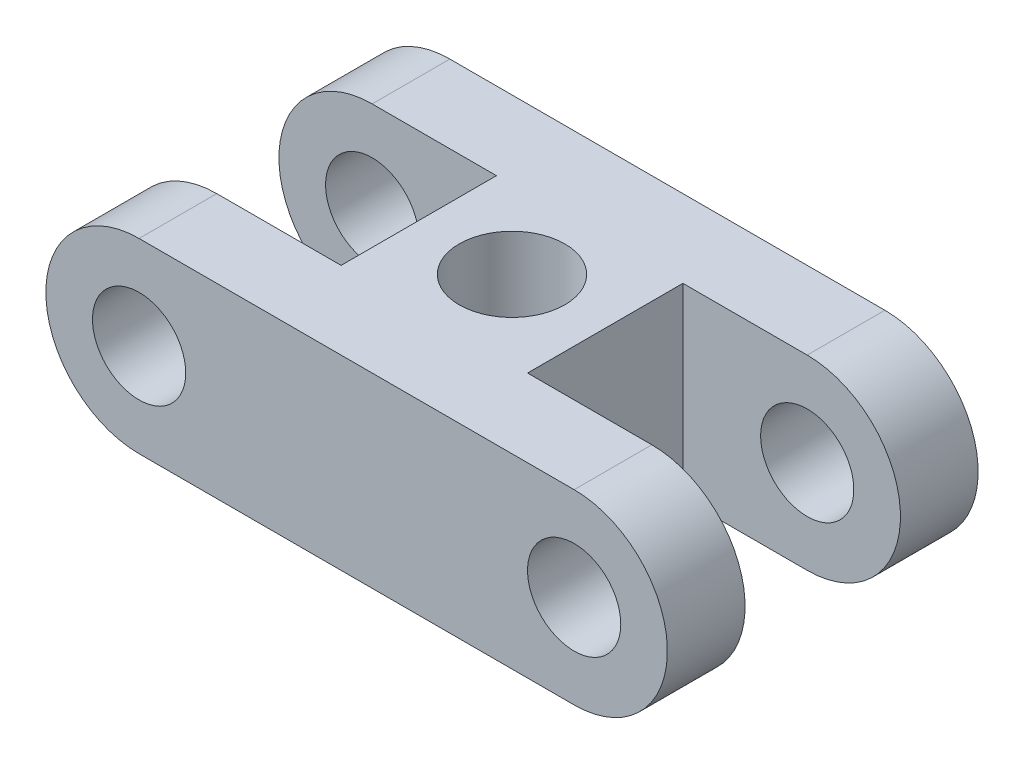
ISO-10303-21;
HEADER;
FILE_DESCRIPTION(('STEP AP214'),'2;1');
FILE_NAME('part.step','',(''),(''),'','','');
FILE_SCHEMA(('AUTOMOTIVE_DESIGN { 1 0 10303 214 1 1 1 1 }'));
ENDSEC;
DATA;
#1=APPLICATION_CONTEXT('core data for automotive mechanical design processes');
#2=APPLICATION_PROTOCOL_DEFINITION('international standard','automotive_design',2000,#1);
#3=PRODUCT_CONTEXT('',#1,'mechanical');
#4=PRODUCT('Part','Part','',(#3));
#5=PRODUCT_RELATED_PRODUCT_CATEGORY('part','',(#4));
#6=PRODUCT_DEFINITION_FORMATION('','',#4);
#7=PRODUCT_DEFINITION_CONTEXT('part definition',#1,'design');
#8=PRODUCT_DEFINITION('design','',#6,#7);
#9=PRODUCT_DEFINITION_SHAPE('','',#8);
#10=(LENGTH_UNIT() NAMED_UNIT(*) SI_UNIT(.MILLI.,.METRE.));
#11=(NAMED_UNIT(*) PLANE_ANGLE_UNIT() SI_UNIT($,.RADIAN.));
#12=(NAMED_UNIT(*) SI_UNIT($,.STERADIAN.) SOLID_ANGLE_UNIT());
#13=UNCERTAINTY_MEASURE_WITH_UNIT(LENGTH_MEASURE(1.E-05),#10,'distance_accuracy_value','');
#14=(GEOMETRIC_REPRESENTATION_CONTEXT(3) GLOBAL_UNCERTAINTY_ASSIGNED_CONTEXT((#13)) GLOBAL_UNIT_ASSIGNED_CONTEXT((#10,
#11,#12)) REPRESENTATION_CONTEXT('',''));
#15=CARTESIAN_POINT('',(0.,0.,0.));
#16=DIRECTION('',(0.,0.,1.));
#17=DIRECTION('',(1.,0.,0.));
#18=AXIS2_PLACEMENT_3D('',#15,#16,#17);
#19=CARTESIAN_POINT('',(-14.,0.,10.));
#20=DIRECTION('',(0.,0.,-1.));
#21=DIRECTION('',(-1.,0.,0.));
#22=AXIS2_PLACEMENT_3D('',#19,#20,#21);
#23=CYLINDRICAL_SURFACE('',#22,6.);
#24=DIRECTION('',(0.,0.,-1.));
#25=VECTOR('',#24,1.);
#26=CARTESIAN_POINT('',(-14.,6.,10.));
#27=LINE('',#26,#25);
#28=CARTESIAN_POINT('',(-14.,6.,10.));
#29=VERTEX_POINT('',#28);
#30=CARTESIAN_POINT('',(-14.,6.,5.));
#31=VERTEX_POINT('',#30);
#32=EDGE_CURVE('E224',#29,#31,#27,.T.);
#33=ORIENTED_EDGE('',*,*,#32,.T.);
#34=CARTESIAN_POINT('',(-14.,0.,5.));
#35=DIRECTION('',(0.,0.,1.));
#36=DIRECTION('',(1.,0.,0.));
#37=AXIS2_PLACEMENT_3D('',#34,#35,#36);
#38=CIRCLE('',#37,6.);
#39=CARTESIAN_POINT('',(-14.,-6.00000000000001,5.));
#40=VERTEX_POINT('',#39);
#41=EDGE_CURVE('E183',#31,#40,#38,.T.);
#42=ORIENTED_EDGE('',*,*,#41,.T.);
#43=DIRECTION('',(0.,0.,-1.));
#44=VECTOR('',#43,1.);
#45=CARTESIAN_POINT('',(-14.,-6.,10.));
#46=LINE('',#45,#44);
#47=CARTESIAN_POINT('',(-14.,-6.,10.));
#48=VERTEX_POINT('',#47);
#49=EDGE_CURVE('E236',#48,#40,#46,.T.);
#50=ORIENTED_EDGE('',*,*,#49,.F.);
#51=CARTESIAN_POINT('',(-14.,0.,10.));
#52=DIRECTION('',(0.,0.,1.));
#53=DIRECTION('',(1.,0.,0.));
#54=AXIS2_PLACEMENT_3D('',#51,#52,#53);
#55=CIRCLE('',#54,6.);
#56=EDGE_CURVE('E203',#29,#48,#55,.T.);
#57=ORIENTED_EDGE('',*,*,#56,.F.);
#58=EDGE_LOOP('',(#33,#42,#50,#57));
#59=FACE_BOUND('',#58,.T.);
#60=ADVANCED_FACE('F37',(#59),#23,.T.);
#61=CARTESIAN_POINT('',(14.,0.,10.));
#62=DIRECTION('',(0.,0.,-1.));
#63=DIRECTION('',(-1.,0.,0.));
#64=AXIS2_PLACEMENT_3D('',#61,#62,#63);
#65=CYLINDRICAL_SURFACE('',#64,6.);
#66=DIRECTION('',(0.,0.,-1.));
#67=VECTOR('',#66,1.);
#68=CARTESIAN_POINT('',(14.,6.00000000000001,10.));
#69=LINE('',#68,#67);
#70=CARTESIAN_POINT('',(14.,6.00000000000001,-5.));
#71=VERTEX_POINT('',#70);
#72=CARTESIAN_POINT('',(14.,6.00000000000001,-10.));
#73=VERTEX_POINT('',#72);
#74=EDGE_CURVE('E227',#71,#73,#69,.T.);
#75=ORIENTED_EDGE('',*,*,#74,.F.);
#76=CARTESIAN_POINT('',(14.,0.,-5.));
#77=DIRECTION('',(0.,0.,-1.));
#78=DIRECTION('',(-1.,0.,0.));
#79=AXIS2_PLACEMENT_3D('',#76,#77,#78);
#80=CIRCLE('',#79,6.);
#81=CARTESIAN_POINT('',(14.,-6.,-5.));
#82=VERTEX_POINT('',#81);
#83=EDGE_CURVE('E172',#71,#82,#80,.T.);
#84=ORIENTED_EDGE('',*,*,#83,.T.);
#85=DIRECTION('',(0.,0.,-1.));
#86=VECTOR('',#85,1.);
#87=CARTESIAN_POINT('',(14.,-5.99999999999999,10.));
#88=LINE('',#87,#86);
#89=CARTESIAN_POINT('',(14.,-5.99999999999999,-10.));
#90=VERTEX_POINT('',#89);
#91=EDGE_CURVE('E231',#82,#90,#88,.T.);
#92=ORIENTED_EDGE('',*,*,#91,.T.);
#93=CARTESIAN_POINT('',(14.,0.,-10.));
#94=DIRECTION('',(0.,0.,1.));
#95=DIRECTION('',(1.,0.,0.));
#96=AXIS2_PLACEMENT_3D('',#93,#94,#95);
#97=CIRCLE('',#96,6.);
#98=EDGE_CURVE('E219',#90,#73,#97,.T.);
#99=ORIENTED_EDGE('',*,*,#98,.T.);
#100=EDGE_LOOP('',(#75,#84,#92,#99));
#101=FACE_BOUND('',#100,.T.);
#102=ADVANCED_FACE('F258',(#101),#65,.T.);
#103=CARTESIAN_POINT('',(-14.,0.,10.));
#104=DIRECTION('',(0.,0.,-1.));
#105=DIRECTION('',(-1.,0.,0.));
#106=AXIS2_PLACEMENT_3D('',#103,#104,#105);
#107=CYLINDRICAL_SURFACE('',#106,3.);
#108=CARTESIAN_POINT('',(-14.,0.,5.));
#109=DIRECTION('',(0.,0.,1.));
#110=DIRECTION('',(1.,0.,0.));
#111=AXIS2_PLACEMENT_3D('',#108,#109,#110);
#112=CIRCLE('',#111,3.);
#113=CARTESIAN_POINT('',(-11.,0.,5.));
#114=VERTEX_POINT('',#113);
#115=EDGE_CURVE('E179',#114,#114,#112,.T.);
#116=ORIENTED_EDGE('',*,*,#115,.F.);
#117=EDGE_LOOP('',(#116));
#118=FACE_BOUND('',#117,.T.);
#119=CARTESIAN_POINT('',(-14.,0.,10.));
#120=DIRECTION('',(0.,0.,1.));
#121=DIRECTION('',(1.,0.,0.));
#122=AXIS2_PLACEMENT_3D('',#119,#120,#121);
#123=CIRCLE('',#122,3.);
#124=CARTESIAN_POINT('',(-11.,0.,10.));
#125=VERTEX_POINT('',#124);
#126=EDGE_CURVE('E197',#125,#125,#123,.T.);
#127=ORIENTED_EDGE('',*,*,#126,.T.);
#128=EDGE_LOOP('',(#127));
#129=FACE_BOUND('',#128,.T.);
#130=ADVANCED_FACE('F283',(#118,#129),#107,.F.);
#131=CARTESIAN_POINT('',(14.,0.,10.));
#132=DIRECTION('',(0.,0.,-1.));
#133=DIRECTION('',(-1.,0.,0.));
#134=AXIS2_PLACEMENT_3D('',#131,#132,#133);
#135=CYLINDRICAL_SURFACE('',#134,3.);
#136=CARTESIAN_POINT('',(14.,0.,-5.));
#137=DIRECTION('',(0.,0.,-1.));
#138=DIRECTION('',(-1.,0.,0.));
#139=AXIS2_PLACEMENT_3D('',#136,#137,#138);
#140=CIRCLE('',#139,3.);
#141=CARTESIAN_POINT('',(11.,0.,-5.));
#142=VERTEX_POINT('',#141);
#143=EDGE_CURVE('E168',#142,#142,#140,.T.);
#144=ORIENTED_EDGE('',*,*,#143,.F.);
#145=EDGE_LOOP('',(#144));
#146=FACE_BOUND('',#145,.T.);
#147=CARTESIAN_POINT('',(14.,0.,-10.));
#148=DIRECTION('',(0.,0.,1.));
#149=DIRECTION('',(1.,0.,0.));
#150=AXIS2_PLACEMENT_3D('',#147,#148,#149);
#151=CIRCLE('',#150,3.);
#152=CARTESIAN_POINT('',(17.,0.,-10.));
#153=VERTEX_POINT('',#152);
#154=EDGE_CURVE('E194',#153,#153,#151,.T.);
#155=ORIENTED_EDGE('',*,*,#154,.F.);
#156=EDGE_LOOP('',(#155));
#157=FACE_BOUND('',#156,.T.);
#158=ADVANCED_FACE('F320',(#146,#157),#135,.F.);
#159=CARTESIAN_POINT('',(-14.,0.,10.));
#160=DIRECTION('',(0.,0.,1.));
#161=DIRECTION('',(1.,0.,0.));
#162=AXIS2_PLACEMENT_3D('',#159,#160,#161);
#163=PLANE('',#162);
#164=ORIENTED_EDGE('',*,*,#126,.F.);
#165=EDGE_LOOP('',(#164));
#166=FACE_BOUND('',#165,.T.);
#167=ORIENTED_EDGE('',*,*,#56,.T.);
#168=DIRECTION('',(1.,0.,0.));
#169=VECTOR('',#168,1.);
#170=CARTESIAN_POINT('',(-14.,-6.,10.));
#171=LINE('',#170,#169);
#172=CARTESIAN_POINT('',(14.,-5.99999999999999,10.));
#173=VERTEX_POINT('',#172);
#174=EDGE_CURVE('E206',#48,#173,#171,.T.);
#175=ORIENTED_EDGE('',*,*,#174,.T.);
#176=CARTESIAN_POINT('',(14.,0.,10.));
#177=DIRECTION('',(0.,0.,1.));
#178=DIRECTION('',(1.,0.,0.));
#179=AXIS2_PLACEMENT_3D('',#176,#177,#178);
#180=CIRCLE('',#179,6.);
#181=CARTESIAN_POINT('',(14.,6.00000000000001,10.));
#182=VERTEX_POINT('',#181);
#183=EDGE_CURVE('E209',#173,#182,#180,.T.);
#184=ORIENTED_EDGE('',*,*,#183,.T.);
#185=DIRECTION('',(-1.,0.,0.));
#186=VECTOR('',#185,1.);
#187=CARTESIAN_POINT('',(-14.,6.,10.));
#188=LINE('',#187,#186);
#189=EDGE_CURVE('E211',#182,#29,#188,.T.);
#190=ORIENTED_EDGE('',*,*,#189,.T.);
#191=EDGE_LOOP('',(#167,#175,#184,#190));
#192=FACE_BOUND('',#191,.T.);
#193=CARTESIAN_POINT('',(14.,0.,10.));
#194=DIRECTION('',(0.,0.,1.));
#195=DIRECTION('',(1.,0.,0.));
#196=AXIS2_PLACEMENT_3D('',#193,#194,#195);
#197=CIRCLE('',#196,3.);
#198=CARTESIAN_POINT('',(17.,0.,10.));
#199=VERTEX_POINT('',#198);
#200=EDGE_CURVE('E190',#199,#199,#197,.T.);
#201=ORIENTED_EDGE('',*,*,#200,.F.);
#202=EDGE_LOOP('',(#201));
#203=FACE_BOUND('',#202,.T.);
#204=ADVANCED_FACE('F276',(#166,#192,#203),#163,.T.);
#205=CARTESIAN_POINT('',(-14.,0.,-10.));
#206=DIRECTION('',(0.,0.,1.));
#207=DIRECTION('',(1.,0.,0.));
#208=AXIS2_PLACEMENT_3D('',#205,#206,#207);
#209=PLANE('',#208);
#210=CARTESIAN_POINT('',(-14.,0.,-10.));
#211=DIRECTION('',(0.,0.,1.));
#212=DIRECTION('',(1.,0.,0.));
#213=AXIS2_PLACEMENT_3D('',#210,#211,#212);
#214=CIRCLE('',#213,6.);
#215=CARTESIAN_POINT('',(-14.,6.,-10.));
#216=VERTEX_POINT('',#215);
#217=CARTESIAN_POINT('',(-14.,-6.,-10.));
#218=VERTEX_POINT('',#217);
#219=EDGE_CURVE('E200',#216,#218,#214,.T.);
#220=ORIENTED_EDGE('',*,*,#219,.F.);
#221=DIRECTION('',(-1.,0.,0.));
#222=VECTOR('',#221,1.);
#223=CARTESIAN_POINT('',(-14.,6.,-10.));
#224=LINE('',#223,#222);
#225=EDGE_CURVE('E207',#73,#216,#224,.T.);
#226=ORIENTED_EDGE('',*,*,#225,.F.);
#227=ORIENTED_EDGE('',*,*,#98,.F.);
#228=DIRECTION('',(1.,0.,0.));
#229=VECTOR('',#228,1.);
#230=CARTESIAN_POINT('',(-14.,-6.,-10.));
#231=LINE('',#230,#229);
#232=EDGE_CURVE('E216',#218,#90,#231,.T.);
#233=ORIENTED_EDGE('',*,*,#232,.F.);
#234=EDGE_LOOP('',(#220,#226,#227,#233));
#235=FACE_BOUND('',#234,.T.);
#236=CARTESIAN_POINT('',(-14.,0.,-10.));
#237=DIRECTION('',(0.,0.,1.));
#238=DIRECTION('',(1.,0.,0.));
#239=AXIS2_PLACEMENT_3D('',#236,#237,#238);
#240=CIRCLE('',#239,3.);
#241=CARTESIAN_POINT('',(-11.,0.,-10.));
#242=VERTEX_POINT('',#241);
#243=EDGE_CURVE('E193',#242,#242,#240,.T.);
#244=ORIENTED_EDGE('',*,*,#243,.T.);
#245=EDGE_LOOP('',(#244));
#246=FACE_BOUND('',#245,.T.);
#247=ORIENTED_EDGE('',*,*,#154,.T.);
#248=EDGE_LOOP('',(#247));
#249=FACE_BOUND('',#248,.T.);
#250=ADVANCED_FACE('F264',(#235,#246,#249),#209,.F.);
#251=CARTESIAN_POINT('',(-14.,-6.00000000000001,-5.));
#252=VERTEX_POINT('',#251);
#253=EDGE_CURVE('E235',#252,#218,#46,.T.);
#254=ORIENTED_EDGE('',*,*,#253,.F.);
#255=CARTESIAN_POINT('',(-14.,0.,-5.));
#256=DIRECTION('',(0.,0.,-1.));
#257=DIRECTION('',(-1.,0.,0.));
#258=AXIS2_PLACEMENT_3D('',#255,#256,#257);
#259=CIRCLE('',#258,6.);
#260=CARTESIAN_POINT('',(-14.,6.,-5.));
#261=VERTEX_POINT('',#260);
#262=EDGE_CURVE('E138',#252,#261,#259,.T.);
#263=ORIENTED_EDGE('',*,*,#262,.T.);
#264=EDGE_CURVE('E213',#261,#216,#27,.T.);
#265=ORIENTED_EDGE('',*,*,#264,.T.);
#266=ORIENTED_EDGE('',*,*,#219,.T.);
#267=EDGE_LOOP('',(#254,#263,#265,#266));
#268=FACE_BOUND('',#267,.T.);
#269=ADVANCED_FACE('F39',(#268),#23,.T.);
#270=CARTESIAN_POINT('',(-14.,-6.,10.));
#271=DIRECTION('',(0.,1.,0.));
#272=DIRECTION('',(-1.,0.,0.));
#273=AXIS2_PLACEMENT_3D('',#270,#271,#272);
#274=PLANE('',#273);
#275=CARTESIAN_POINT('',(0.,-6.,0.));
#276=DIRECTION('',(0.,1.,0.));
#277=DIRECTION('',(-1.,0.,0.));
#278=AXIS2_PLACEMENT_3D('',#275,#276,#277);
#279=CIRCLE('',#278,3.4);
#280=CARTESIAN_POINT('',(-3.4,-6.00000000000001,0.));
#281=VERTEX_POINT('',#280);
#282=EDGE_CURVE('E186',#281,#281,#279,.T.);
#283=ORIENTED_EDGE('',*,*,#282,.T.);
#284=EDGE_LOOP('',(#283));
#285=FACE_BOUND('',#284,.T.);
#286=ORIENTED_EDGE('',*,*,#49,.T.);
#287=DIRECTION('',(1.,0.,0.));
#288=VECTOR('',#287,1.);
#289=CARTESIAN_POINT('',(-34.,-6.00000000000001,5.));
#290=LINE('',#289,#288);
#291=CARTESIAN_POINT('',(-6.,-6.00000000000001,5.));
#292=VERTEX_POINT('',#291);
#293=EDGE_CURVE('E132',#40,#292,#290,.T.);
#294=ORIENTED_EDGE('',*,*,#293,.T.);
#295=DIRECTION('',(0.,0.,-1.));
#296=VECTOR('',#295,1.);
#297=CARTESIAN_POINT('',(-6.,-6.00000000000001,-5.));
#298=LINE('',#297,#296);
#299=CARTESIAN_POINT('',(-6.,-6.00000000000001,-5.));
#300=VERTEX_POINT('',#299);
#301=EDGE_CURVE('E128',#292,#300,#298,.T.);
#302=ORIENTED_EDGE('',*,*,#301,.T.);
#303=DIRECTION('',(-1.,0.,0.));
#304=VECTOR('',#303,1.);
#305=CARTESIAN_POINT('',(-34.,-6.00000000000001,-5.));
#306=LINE('',#305,#304);
#307=EDGE_CURVE('E135',#300,#252,#306,.T.);
#308=ORIENTED_EDGE('',*,*,#307,.T.);
#309=ORIENTED_EDGE('',*,*,#253,.T.);
#310=ORIENTED_EDGE('',*,*,#232,.T.);
#311=ORIENTED_EDGE('',*,*,#91,.F.);
#312=DIRECTION('',(-1.,0.,0.));
#313=VECTOR('',#312,1.);
#314=CARTESIAN_POINT('',(34.,-6.,-5.));
#315=LINE('',#314,#313);
#316=CARTESIAN_POINT('',(6.,-6.,-5.));
#317=VERTEX_POINT('',#316);
#318=EDGE_CURVE('E158',#82,#317,#315,.T.);
#319=ORIENTED_EDGE('',*,*,#318,.T.);
#320=DIRECTION('',(0.,0.,1.));
#321=VECTOR('',#320,1.);
#322=CARTESIAN_POINT('',(6.,-6.,-5.));
#323=LINE('',#322,#321);
#324=CARTESIAN_POINT('',(6.,-6.,5.));
#325=VERTEX_POINT('',#324);
#326=EDGE_CURVE('E152',#317,#325,#323,.T.);
#327=ORIENTED_EDGE('',*,*,#326,.T.);
#328=DIRECTION('',(1.,0.,0.));
#329=VECTOR('',#328,1.);
#330=CARTESIAN_POINT('',(34.,-6.,5.));
#331=LINE('',#330,#329);
#332=CARTESIAN_POINT('',(14.,-6.,5.));
#333=VERTEX_POINT('',#332);
#334=EDGE_CURVE('E155',#325,#333,#331,.T.);
#335=ORIENTED_EDGE('',*,*,#334,.T.);
#336=EDGE_CURVE('E232',#173,#333,#88,.T.);
#337=ORIENTED_EDGE('',*,*,#336,.F.);
#338=ORIENTED_EDGE('',*,*,#174,.F.);
#339=EDGE_LOOP('',(#286,#294,#302,#308,#309,#310,#311,#319,#327,#335,#337,#338));
#340=FACE_BOUND('',#339,.T.);
#341=ADVANCED_FACE('F143',(#285,#340),#274,.F.);
#342=ORIENTED_EDGE('',*,*,#336,.T.);
#343=CARTESIAN_POINT('',(14.,0.,5.));
#344=DIRECTION('',(0.,0.,1.));
#345=DIRECTION('',(1.,0.,0.));
#346=AXIS2_PLACEMENT_3D('',#343,#344,#345);
#347=CIRCLE('',#346,6.);
#348=CARTESIAN_POINT('',(14.,6.00000000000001,5.));
#349=VERTEX_POINT('',#348);
#350=EDGE_CURVE('E165',#333,#349,#347,.T.);
#351=ORIENTED_EDGE('',*,*,#350,.T.);
#352=EDGE_CURVE('E228',#182,#349,#69,.T.);
#353=ORIENTED_EDGE('',*,*,#352,.F.);
#354=ORIENTED_EDGE('',*,*,#183,.F.);
#355=EDGE_LOOP('',(#342,#351,#353,#354));
#356=FACE_BOUND('',#355,.T.);
#357=ADVANCED_FACE('F273',(#356),#65,.T.);
#358=CARTESIAN_POINT('',(-14.,6.,10.));
#359=DIRECTION('',(0.,-1.,0.));
#360=DIRECTION('',(1.,0.,0.));
#361=AXIS2_PLACEMENT_3D('',#358,#359,#360);
#362=PLANE('',#361);
#363=CARTESIAN_POINT('',(0.,6.,0.));
#364=DIRECTION('',(0.,-1.,0.));
#365=DIRECTION('',(1.,0.,0.));
#366=AXIS2_PLACEMENT_3D('',#363,#364,#365);
#367=CIRCLE('',#366,3.4);
#368=CARTESIAN_POINT('',(3.4,6.,0.));
#369=VERTEX_POINT('',#368);
#370=EDGE_CURVE('E189',#369,#369,#367,.T.);
#371=ORIENTED_EDGE('',*,*,#370,.T.);
#372=EDGE_LOOP('',(#371));
#373=FACE_BOUND('',#372,.T.);
#374=DIRECTION('',(0.,0.,1.));
#375=VECTOR('',#374,1.);
#376=CARTESIAN_POINT('',(-6.,6.,10.));
#377=LINE('',#376,#375);
#378=CARTESIAN_POINT('',(-6.,6.,-5.));
#379=VERTEX_POINT('',#378);
#380=CARTESIAN_POINT('',(-6.,6.,5.));
#381=VERTEX_POINT('',#380);
#382=EDGE_CURVE('E11',#379,#381,#377,.T.);
#383=ORIENTED_EDGE('',*,*,#382,.T.);
#384=DIRECTION('',(-1.,0.,0.));
#385=VECTOR('',#384,1.);
#386=CARTESIAN_POINT('',(-14.,6.,5.));
#387=LINE('',#386,#385);
#388=EDGE_CURVE('E180',#381,#31,#387,.T.);
#389=ORIENTED_EDGE('',*,*,#388,.T.);
#390=ORIENTED_EDGE('',*,*,#32,.F.);
#391=ORIENTED_EDGE('',*,*,#189,.F.);
#392=ORIENTED_EDGE('',*,*,#352,.T.);
#393=DIRECTION('',(-1.,0.,0.));
#394=VECTOR('',#393,1.);
#395=CARTESIAN_POINT('',(-14.,6.,5.00000000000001));
#396=LINE('',#395,#394);
#397=CARTESIAN_POINT('',(6.,6.,5.));
#398=VERTEX_POINT('',#397);
#399=EDGE_CURVE('E162',#349,#398,#396,.T.);
#400=ORIENTED_EDGE('',*,*,#399,.T.);
#401=DIRECTION('',(0.,0.,-1.));
#402=VECTOR('',#401,1.);
#403=CARTESIAN_POINT('',(6.,6.,10.));
#404=LINE('',#403,#402);
#405=CARTESIAN_POINT('',(6.,6.,-5.));
#406=VERTEX_POINT('',#405);
#407=EDGE_CURVE('E45',#398,#406,#404,.T.);
#408=ORIENTED_EDGE('',*,*,#407,.T.);
#409=DIRECTION('',(1.,0.,0.));
#410=VECTOR('',#409,1.);
#411=CARTESIAN_POINT('',(-14.,6.,-4.99999999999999));
#412=LINE('',#411,#410);
#413=EDGE_CURVE('E169',#406,#71,#412,.T.);
#414=ORIENTED_EDGE('',*,*,#413,.T.);
#415=ORIENTED_EDGE('',*,*,#74,.T.);
#416=ORIENTED_EDGE('',*,*,#225,.T.);
#417=ORIENTED_EDGE('',*,*,#264,.F.);
#418=DIRECTION('',(1.,0.,0.));
#419=VECTOR('',#418,1.);
#420=CARTESIAN_POINT('',(-14.,6.,-5.));
#421=LINE('',#420,#419);
#422=EDGE_CURVE('E176',#261,#379,#421,.T.);
#423=ORIENTED_EDGE('',*,*,#422,.T.);
#424=EDGE_LOOP('',(#383,#389,#390,#391,#392,#400,#408,#414,#415,#416,#417,#423));
#425=FACE_BOUND('',#424,.T.);
#426=ADVANCED_FACE('F249',(#373,#425),#362,.F.);
#427=CARTESIAN_POINT('',(-14.,0.,-5.));
#428=DIRECTION('',(0.,0.,-1.));
#429=DIRECTION('',(-1.,0.,0.));
#430=AXIS2_PLACEMENT_3D('',#427,#428,#429);
#431=CIRCLE('',#430,3.);
#432=CARTESIAN_POINT('',(-17.,0.,-5.));
#433=VERTEX_POINT('',#432);
#434=EDGE_CURVE('E175',#433,#433,#431,.T.);
#435=ORIENTED_EDGE('',*,*,#434,.F.);
#436=EDGE_LOOP('',(#435));
#437=FACE_BOUND('',#436,.T.);
#438=ORIENTED_EDGE('',*,*,#243,.F.);
#439=EDGE_LOOP('',(#438));
#440=FACE_BOUND('',#439,.T.);
#441=ADVANCED_FACE('F318',(#437,#440),#107,.F.);
#442=CARTESIAN_POINT('',(14.,0.,5.));
#443=DIRECTION('',(0.,0.,1.));
#444=DIRECTION('',(1.,0.,0.));
#445=AXIS2_PLACEMENT_3D('',#442,#443,#444);
#446=CIRCLE('',#445,3.);
#447=CARTESIAN_POINT('',(17.,0.,5.));
#448=VERTEX_POINT('',#447);
#449=EDGE_CURVE('E150',#448,#448,#446,.T.);
#450=ORIENTED_EDGE('',*,*,#449,.F.);
#451=EDGE_LOOP('',(#450));
#452=FACE_BOUND('',#451,.T.);
#453=ORIENTED_EDGE('',*,*,#200,.T.);
#454=EDGE_LOOP('',(#453));
#455=FACE_BOUND('',#454,.T.);
#456=ADVANCED_FACE('F314',(#452,#455),#135,.F.);
#457=CARTESIAN_POINT('',(0.,-6.,0.));
#458=DIRECTION('',(0.,1.,0.));
#459=DIRECTION('',(-1.,0.,0.));
#460=AXIS2_PLACEMENT_3D('',#457,#458,#459);
#461=CYLINDRICAL_SURFACE('',#460,3.4);
#462=ORIENTED_EDGE('',*,*,#282,.F.);
#463=EDGE_LOOP('',(#462));
#464=FACE_BOUND('',#463,.T.);
#465=ORIENTED_EDGE('',*,*,#370,.F.);
#466=EDGE_LOOP('',(#465));
#467=FACE_BOUND('',#466,.T.);
#468=ADVANCED_FACE('F311',(#464,#467),#461,.F.);
#469=CARTESIAN_POINT('',(6.,-6.,-5.));
#470=DIRECTION('',(-1.,0.,0.));
#471=DIRECTION('',(0.,-1.,0.));
#472=AXIS2_PLACEMENT_3D('',#469,#470,#471);
#473=PLANE('',#472);
#474=DIRECTION('',(0.,1.,0.));
#475=VECTOR('',#474,1.);
#476=CARTESIAN_POINT('',(6.,-6.,5.));
#477=LINE('',#476,#475);
#478=EDGE_CURVE('E60',#325,#398,#477,.T.);
#479=ORIENTED_EDGE('',*,*,#478,.F.);
#480=ORIENTED_EDGE('',*,*,#326,.F.);
#481=DIRECTION('',(0.,1.,0.));
#482=VECTOR('',#481,1.);
#483=CARTESIAN_POINT('',(6.,-6.,-5.));
#484=LINE('',#483,#482);
#485=EDGE_CURVE('E144',#317,#406,#484,.T.);
#486=ORIENTED_EDGE('',*,*,#485,.T.);
#487=ORIENTED_EDGE('',*,*,#407,.F.);
#488=EDGE_LOOP('',(#479,#480,#486,#487));
#489=FACE_BOUND('',#488,.T.);
#490=ADVANCED_FACE('F252',(#489),#473,.F.);
#491=CARTESIAN_POINT('',(34.,-6.,-5.));
#492=DIRECTION('',(0.,0.,-1.));
#493=DIRECTION('',(-1.,0.,0.));
#494=AXIS2_PLACEMENT_3D('',#491,#492,#493);
#495=PLANE('',#494);
#496=ORIENTED_EDGE('',*,*,#143,.T.);
#497=EDGE_LOOP('',(#496));
#498=FACE_BOUND('',#497,.T.);
#499=ORIENTED_EDGE('',*,*,#413,.F.);
#500=ORIENTED_EDGE('',*,*,#485,.F.);
#501=ORIENTED_EDGE('',*,*,#318,.F.);
#502=ORIENTED_EDGE('',*,*,#83,.F.);
#503=EDGE_LOOP('',(#499,#500,#501,#502));
#504=FACE_BOUND('',#503,.T.);
#505=ADVANCED_FACE('F255',(#498,#504),#495,.F.);
#506=CARTESIAN_POINT('',(34.,-6.,5.));
#507=DIRECTION('',(0.,0.,1.));
#508=DIRECTION('',(1.,0.,0.));
#509=AXIS2_PLACEMENT_3D('',#506,#507,#508);
#510=PLANE('',#509);
#511=ORIENTED_EDGE('',*,*,#449,.T.);
#512=EDGE_LOOP('',(#511));
#513=FACE_BOUND('',#512,.T.);
#514=ORIENTED_EDGE('',*,*,#334,.F.);
#515=ORIENTED_EDGE('',*,*,#478,.T.);
#516=ORIENTED_EDGE('',*,*,#399,.F.);
#517=ORIENTED_EDGE('',*,*,#350,.F.);
#518=EDGE_LOOP('',(#514,#515,#516,#517));
#519=FACE_BOUND('',#518,.T.);
#520=ADVANCED_FACE('F300',(#513,#519),#510,.F.);
#521=CARTESIAN_POINT('',(-6.,-6.00000000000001,-5.));
#522=DIRECTION('',(1.,0.,0.));
#523=DIRECTION('',(0.,1.,0.));
#524=AXIS2_PLACEMENT_3D('',#521,#522,#523);
#525=PLANE('',#524);
#526=DIRECTION('',(0.,1.,0.));
#527=VECTOR('',#526,1.);
#528=CARTESIAN_POINT('',(-6.,-6.00000000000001,-5.));
#529=LINE('',#528,#527);
#530=EDGE_CURVE('E52',#300,#379,#529,.T.);
#531=ORIENTED_EDGE('',*,*,#530,.F.);
#532=ORIENTED_EDGE('',*,*,#301,.F.);
#533=DIRECTION('',(0.,1.,0.));
#534=VECTOR('',#533,1.);
#535=CARTESIAN_POINT('',(-6.,-6.00000000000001,5.));
#536=LINE('',#535,#534);
#537=EDGE_CURVE('E131',#292,#381,#536,.T.);
#538=ORIENTED_EDGE('',*,*,#537,.T.);
#539=ORIENTED_EDGE('',*,*,#382,.F.);
#540=EDGE_LOOP('',(#531,#532,#538,#539));
#541=FACE_BOUND('',#540,.T.);
#542=ADVANCED_FACE('F125',(#541),#525,.F.);
#543=CARTESIAN_POINT('',(-34.,-6.00000000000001,5.));
#544=DIRECTION('',(0.,0.,1.));
#545=DIRECTION('',(1.,0.,0.));
#546=AXIS2_PLACEMENT_3D('',#543,#544,#545);
#547=PLANE('',#546);
#548=ORIENTED_EDGE('',*,*,#115,.T.);
#549=EDGE_LOOP('',(#548));
#550=FACE_BOUND('',#549,.T.);
#551=ORIENTED_EDGE('',*,*,#388,.F.);
#552=ORIENTED_EDGE('',*,*,#537,.F.);
#553=ORIENTED_EDGE('',*,*,#293,.F.);
#554=ORIENTED_EDGE('',*,*,#41,.F.);
#555=EDGE_LOOP('',(#551,#552,#553,#554));
#556=FACE_BOUND('',#555,.T.);
#557=ADVANCED_FACE('F290',(#550,#556),#547,.F.);
#558=CARTESIAN_POINT('',(-34.,-6.00000000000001,-5.));
#559=DIRECTION('',(0.,0.,-1.));
#560=DIRECTION('',(-1.,0.,0.));
#561=AXIS2_PLACEMENT_3D('',#558,#559,#560);
#562=PLANE('',#561);
#563=ORIENTED_EDGE('',*,*,#434,.T.);
#564=EDGE_LOOP('',(#563));
#565=FACE_BOUND('',#564,.T.);
#566=ORIENTED_EDGE('',*,*,#307,.F.);
#567=ORIENTED_EDGE('',*,*,#530,.T.);
#568=ORIENTED_EDGE('',*,*,#422,.F.);
#569=ORIENTED_EDGE('',*,*,#262,.F.);
#570=EDGE_LOOP('',(#566,#567,#568,#569));
#571=FACE_BOUND('',#570,.T.);
#572=ADVANCED_FACE('F136',(#565,#571),#562,.F.);
#573=CLOSED_SHELL('',(#60,#102,#130,#158,#204,#250,#269,#341,#357,#426,#441,#456,#468,#490,#505,
#520,#542,#557,#572));
#574=MANIFOLD_SOLID_BREP('B2',#573);
#575=ADVANCED_BREP_SHAPE_REPRESENTATION('',(#18,#574),#14);
#576=SHAPE_DEFINITION_REPRESENTATION(#9,#575);
ENDSEC;
END-ISO-10303-21;
